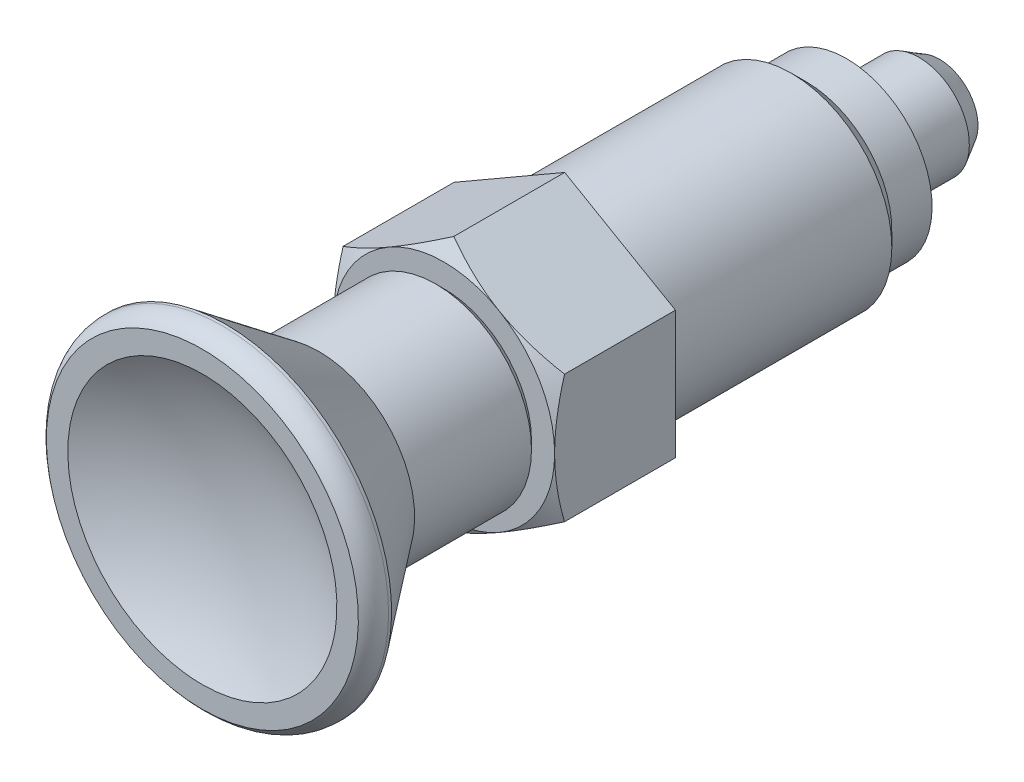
ISO-10303-21;
HEADER;
FILE_DESCRIPTION(('STEP AP214'),'2;1');
FILE_NAME('part.step','',(''),(''),'','','');
FILE_SCHEMA(('AUTOMOTIVE_DESIGN { 1 0 10303 214 1 1 1 1 }'));
ENDSEC;
DATA;
#1=APPLICATION_CONTEXT('core data for automotive mechanical design processes');
#2=APPLICATION_PROTOCOL_DEFINITION('international standard','automotive_design',2000,#1);
#3=PRODUCT_CONTEXT('',#1,'mechanical');
#4=PRODUCT('Part','Part','',(#3));
#5=PRODUCT_RELATED_PRODUCT_CATEGORY('part','',(#4));
#6=PRODUCT_DEFINITION_FORMATION('','',#4);
#7=PRODUCT_DEFINITION_CONTEXT('part definition',#1,'design');
#8=PRODUCT_DEFINITION('design','',#6,#7);
#9=PRODUCT_DEFINITION_SHAPE('','',#8);
#10=(LENGTH_UNIT() NAMED_UNIT(*) SI_UNIT(.MILLI.,.METRE.));
#11=(NAMED_UNIT(*) PLANE_ANGLE_UNIT() SI_UNIT($,.RADIAN.));
#12=(NAMED_UNIT(*) SI_UNIT($,.STERADIAN.) SOLID_ANGLE_UNIT());
#13=UNCERTAINTY_MEASURE_WITH_UNIT(LENGTH_MEASURE(1.E-05),#10,'distance_accuracy_value','');
#14=(GEOMETRIC_REPRESENTATION_CONTEXT(3) GLOBAL_UNCERTAINTY_ASSIGNED_CONTEXT((#13)) GLOBAL_UNIT_ASSIGNED_CONTEXT((#10,
#11,#12)) REPRESENTATION_CONTEXT('',''));
#15=CARTESIAN_POINT('',(0.,0.,0.));
#16=DIRECTION('',(0.,0.,1.));
#17=DIRECTION('',(1.,0.,0.));
#18=AXIS2_PLACEMENT_3D('',#15,#16,#17);
#19=CARTESIAN_POINT('',(0.,0.,58.3));
#20=DIRECTION('',(1.,0.,0.));
#21=DIRECTION('',(0.,-1.,0.));
#22=AXIS2_PLACEMENT_3D('',#19,#20,#21);
#23=SPHERICAL_SURFACE('',#22,26.);
#24=CARTESIAN_POINT('',(0.,-13.3682459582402,36.));
#25=CARTESIAN_POINT('',(0.375585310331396,-13.3682486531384,36.));
#26=CARTESIAN_POINT('',(0.751126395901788,-13.3524111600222,36.));
#27=CARTESIAN_POINT('',(1.49966463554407,-13.2891717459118,36.));
#28=CARTESIAN_POINT('',(1.87266109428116,-13.2417615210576,36.));
#29=CARTESIAN_POINT('',(2.61372997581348,-13.1156339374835,36.));
#30=CARTESIAN_POINT('',(2.98179666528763,-13.0368829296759,36.));
#31=CARTESIAN_POINT('',(3.70998226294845,-12.8486360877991,36.));
#32=CARTESIAN_POINT('',(4.07010119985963,-12.7391403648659,36.));
#33=CARTESIAN_POINT('',(4.77965529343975,-12.4902434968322,36.));
#34=CARTESIAN_POINT('',(5.12909553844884,-12.3508568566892,36.));
#35=CARTESIAN_POINT('',(5.8149955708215,-12.0431356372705,36.));
#36=CARTESIAN_POINT('',(6.15145515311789,-11.8748006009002,36.));
#37=CARTESIAN_POINT('',(6.80891126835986,-11.5104276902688,36.));
#38=CARTESIAN_POINT('',(7.12991172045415,-11.314396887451,36.));
#39=CARTESIAN_POINT('',(7.75425858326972,-10.8959942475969,36.));
#40=CARTESIAN_POINT('',(8.05760506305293,-10.673622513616,36.));
#41=CARTESIAN_POINT('',(8.64452045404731,-10.2040929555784,36.));
#42=CARTESIAN_POINT('',(8.92808725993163,-9.95693249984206,36.));
#43=CARTESIAN_POINT('',(9.4733922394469,-9.43960204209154,36.));
#44=CARTESIAN_POINT('',(9.7351303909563,-9.16943201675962,36.));
#45=CARTESIAN_POINT('',(10.2349267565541,-8.60799236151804,36.));
#46=CARTESIAN_POINT('',(10.472984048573,-8.31672191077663,36.));
#47=CARTESIAN_POINT('',(10.9237145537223,-7.7151616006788,36.));
#48=CARTESIAN_POINT('',(11.1363877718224,-7.40487174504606,36.));
#49=CARTESIAN_POINT('',(11.5348344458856,-6.76748455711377,36.));
#50=CARTESIAN_POINT('',(11.7206084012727,-6.44038753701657,36.));
#51=CARTESIAN_POINT('',(12.063940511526,-5.77170618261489,36.));
#52=CARTESIAN_POINT('',(12.2214986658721,-5.43012184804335,36.));
#53=CARTESIAN_POINT('',(12.5072787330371,-4.73489504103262,36.));
#54=CARTESIAN_POINT('',(12.6355007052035,-4.38125259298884,36.));
#55=CARTESIAN_POINT('',(12.8616972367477,-3.66442308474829,36.));
#56=CARTESIAN_POINT('',(12.9596717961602,-3.30123602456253,36.));
#57=CARTESIAN_POINT('',(13.1246771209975,-2.56789862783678,36.));
#58=CARTESIAN_POINT('',(13.1917078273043,-2.19774827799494,36.));
#59=CARTESIAN_POINT('',(13.2943486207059,-1.45311652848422,36.));
#60=CARTESIAN_POINT('',(13.3299587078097,-1.07863512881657,36.));
#61=CARTESIAN_POINT('',(13.3695050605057,-0.328004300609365,36.));
#62=CARTESIAN_POINT('',(13.373441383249,0.0481451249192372,36.));
#63=CARTESIAN_POINT('',(13.3496123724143,0.7994384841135,36.));
#64=CARTESIAN_POINT('',(13.3218470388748,1.17458241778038,36.));
#65=CARTESIAN_POINT('',(13.2348120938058,1.92119788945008,36.));
#66=CARTESIAN_POINT('',(13.1755424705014,2.29266942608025,36.));
#67=CARTESIAN_POINT('',(13.0259203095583,3.02929902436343,36.));
#68=CARTESIAN_POINT('',(12.9355677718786,3.39445708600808,36.));
#69=CARTESIAN_POINT('',(12.7244220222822,4.11586406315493,36.));
#70=CARTESIAN_POINT('',(12.6036287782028,4.47211296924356,36.));
#71=CARTESIAN_POINT('',(12.3324604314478,5.17316851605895,36.));
#72=CARTESIAN_POINT('',(12.182085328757,5.51797515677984,36.));
#73=CARTESIAN_POINT('',(11.8528223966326,6.19369469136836,36.));
#74=CARTESIAN_POINT('',(11.6739345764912,6.5246075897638,36.));
#75=CARTESIAN_POINT('',(11.2889179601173,7.17018716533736,36.));
#76=CARTESIAN_POINT('',(11.0827891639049,7.48485384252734,36.));
#77=CARTESIAN_POINT('',(10.644756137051,8.09570375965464,36.));
#78=CARTESIAN_POINT('',(10.4128519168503,8.39188700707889,36.));
#79=CARTESIAN_POINT('',(9.92491667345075,8.96366451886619,36.));
#80=CARTESIAN_POINT('',(9.66888565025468,9.23925878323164,36.));
#81=CARTESIAN_POINT('',(9.13451699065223,9.76789905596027,36.));
#82=CARTESIAN_POINT('',(8.85617935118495,10.0209450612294,36.));
#83=CARTESIAN_POINT('',(8.2791763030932,10.5026897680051,36.));
#84=CARTESIAN_POINT('',(7.98051089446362,10.7313884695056,36.));
#85=CARTESIAN_POINT('',(7.36497559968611,11.1628126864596,36.));
#86=CARTESIAN_POINT('',(7.04810571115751,11.3655381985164,36.));
#87=CARTESIAN_POINT('',(6.39841424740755,11.7435747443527,36.));
#88=CARTESIAN_POINT('',(6.06559267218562,11.9188857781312,36.));
#89=CARTESIAN_POINT('',(5.38636401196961,12.2408470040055,36.));
#90=CARTESIAN_POINT('',(5.03995692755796,12.3874971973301,36.));
#91=CARTESIAN_POINT('',(4.33601998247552,12.6510941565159,36.));
#92=CARTESIAN_POINT('',(3.9784901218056,12.7680409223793,36.));
#93=CARTESIAN_POINT('',(3.25484946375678,12.9713996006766,36.));
#94=CARTESIAN_POINT('',(2.8887386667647,13.0578115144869,36.));
#95=CARTESIAN_POINT('',(2.15053894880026,13.1994861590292,36.));
#96=CARTESIAN_POINT('',(1.77845002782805,13.2547488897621,36.));
#97=CARTESIAN_POINT('',(1.03093939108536,13.3337322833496,36.));
#98=CARTESIAN_POINT('',(0.655517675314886,13.3574529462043,36.));
#99=CARTESIAN_POINT('',(-0.0959895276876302,13.3731835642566,36.));
#100=CARTESIAN_POINT('',(-0.472075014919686,13.3651935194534,36.));
#101=CARTESIAN_POINT('',(-1.22223603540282,13.3175595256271,36.));
#102=CARTESIAN_POINT('',(-1.5963115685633,13.277915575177,36.));
#103=CARTESIAN_POINT('',(-2.33979321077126,13.1672556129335,36.));
#104=CARTESIAN_POINT('',(-2.70919931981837,13.0962396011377,36.));
#105=CARTESIAN_POINT('',(-3.44071587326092,12.9233403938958,36.));
#106=CARTESIAN_POINT('',(-3.80282631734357,12.8214571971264,36.));
#107=CARTESIAN_POINT('',(-4.51717713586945,12.5875479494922,36.));
#108=CARTESIAN_POINT('',(-4.86941751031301,12.4555218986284,36.));
#109=CARTESIAN_POINT('',(-5.56152392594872,12.1622655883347,36.));
#110=CARTESIAN_POINT('',(-5.90138996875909,12.001035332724,36.));
#111=CARTESIAN_POINT('',(-6.56633152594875,11.6505168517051,36.));
#112=CARTESIAN_POINT('',(-6.89140704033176,11.461228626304,36.));
#113=CARTESIAN_POINT('',(-7.52445640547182,11.0559399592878,36.));
#114=CARTESIAN_POINT('',(-7.83243025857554,10.8399395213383,36.));
#115=CARTESIAN_POINT('',(-8.42908684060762,10.3827620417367,36.));
#116=CARTESIAN_POINT('',(-8.71776956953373,10.1415850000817,36.));
#117=CARTESIAN_POINT('',(-9.27379165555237,9.63576883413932,36.));
#118=CARTESIAN_POINT('',(-9.54113100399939,9.37112970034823,36.));
#119=CARTESIAN_POINT('',(-10.0525655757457,8.82027085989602,36.));
#120=CARTESIAN_POINT('',(-10.296660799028,8.53405115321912,36.));
#121=CARTESIAN_POINT('',(-10.7598718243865,7.9420659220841,36.));
#122=CARTESIAN_POINT('',(-10.9789876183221,7.63630039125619,36.));
#123=CARTESIAN_POINT('',(-11.3906819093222,7.0073974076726,36.));
#124=CARTESIAN_POINT('',(-11.5832604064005,6.68425995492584,36.));
#125=CARTESIAN_POINT('',(-11.9405107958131,6.02291079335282,36.));
#126=CARTESIAN_POINT('',(-12.1051827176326,5.68469910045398,36.));
#127=CARTESIAN_POINT('',(-12.405449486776,4.9956056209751,36.));
#128=CARTESIAN_POINT('',(-12.5410443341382,4.64472383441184,36.));
#129=CARTESIAN_POINT('',(-12.782192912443,3.93278485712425,36.));
#130=CARTESIAN_POINT('',(-12.8877466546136,3.5717276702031,36.));
#131=CARTESIAN_POINT('',(-13.0680626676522,2.84200466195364,36.));
#132=CARTESIAN_POINT('',(-13.1428249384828,2.4733388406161,36.));
#133=CARTESIAN_POINT('',(-13.2610266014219,1.73101888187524,36.));
#134=CARTESIAN_POINT('',(-13.3044659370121,1.35736473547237,36.));
#135=CARTESIAN_POINT('',(-13.3597126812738,0.607725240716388,36.));
#136=CARTESIAN_POINT('',(-13.3715200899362,0.231739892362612,36.));
#137=CARTESIAN_POINT('',(-13.3634190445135,-0.519888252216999,36.));
#138=CARTESIAN_POINT('',(-13.3435106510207,-0.895531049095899,36.));
#139=CARTESIAN_POINT('',(-13.2721196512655,-1.64380422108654,36.));
#140=CARTESIAN_POINT('',(-13.2206370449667,-2.01643459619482,36.));
#141=CARTESIAN_POINT('',(-13.0864634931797,-2.75603450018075,36.));
#142=CARTESIAN_POINT('',(-13.0037724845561,-3.12300401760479,36.));
#143=CARTESIAN_POINT('',(-12.8077700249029,-3.84867248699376,36.));
#144=CARTESIAN_POINT('',(-12.6944585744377,-4.20737143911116,36.));
#145=CARTESIAN_POINT('',(-12.4380184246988,-4.91395521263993,36.));
#146=CARTESIAN_POINT('',(-12.2948891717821,-5.26183983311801,36.));
#147=CARTESIAN_POINT('',(-11.9798322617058,-5.94431469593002,36.));
#148=CARTESIAN_POINT('',(-11.8079045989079,-6.27890493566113,36.));
#149=CARTESIAN_POINT('',(-11.4364804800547,-6.93239940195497,36.));
#150=CARTESIAN_POINT('',(-11.2369850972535,-7.25130423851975,36.));
#151=CARTESIAN_POINT('',(-10.8118388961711,-7.87117441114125,36.));
#152=CARTESIAN_POINT('',(-10.5861881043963,-8.17213976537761,36.));
#153=CARTESIAN_POINT('',(-10.110360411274,-8.75396077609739,36.));
#154=CARTESIAN_POINT('',(-9.86018611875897,-9.03481856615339,36.));
#155=CARTESIAN_POINT('',(-9.33706848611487,-9.57446448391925,36.));
#156=CARTESIAN_POINT('',(-9.06412505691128,-9.83325252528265,36.));
#157=CARTESIAN_POINT('',(-8.49733759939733,-10.3269813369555,36.));
#158=CARTESIAN_POINT('',(-8.20348826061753,-10.5619160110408,36.));
#159=CARTESIAN_POINT('',(-7.59704532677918,-11.0061886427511,36.));
#160=CARTESIAN_POINT('',(-7.28445202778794,-11.2155270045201,36.));
#161=CARTESIAN_POINT('',(-6.6425836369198,-11.6072177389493,36.));
#162=CARTESIAN_POINT('',(-6.31330053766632,-11.7895569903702,36.));
#163=CARTESIAN_POINT('',(-5.64053678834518,-12.1258308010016,36.));
#164=CARTESIAN_POINT('',(-5.2970560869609,-12.2797652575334,36.));
#165=CARTESIAN_POINT('',(-4.59871120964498,-12.5579840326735,36.));
#166=CARTESIAN_POINT('',(-4.24385967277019,-12.682300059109,36.));
#167=CARTESIAN_POINT('',(-3.5250673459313,-12.9005804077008,36.));
#168=CARTESIAN_POINT('',(-3.16112897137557,-12.99455270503,36.));
#169=CARTESIAN_POINT('',(-2.33514245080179,-13.1710678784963,36.));
#170=CARTESIAN_POINT('',(-1.87121744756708,-13.2449469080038,36.));
#171=CARTESIAN_POINT('',(-0.938171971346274,-13.3435342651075,36.));
#172=CARTESIAN_POINT('',(-0.46905149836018,-13.3682425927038,36.));
#173=CARTESIAN_POINT('',(0.,-13.3682459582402,36.));
#174=B_SPLINE_CURVE_WITH_KNOTS('',3,(#24,#25,#26,#27,#28,#29,#30,#31,#32,#33,#34,#35,#36,#37,
#38,#39,#40,#41,#42,#43,#44,#45,#46,#47,#48,#49,#50,#51,#52,#53,#54,#55,#56,#57,#58,#59,#60,#61,
#62,#63,#64,#65,#66,#67,#68,#69,#70,#71,#72,#73,#74,#75,#76,#77,#78,#79,#80,#81,#82,#83,#84,#85,
#86,#87,#88,#89,#90,#91,#92,#93,#94,#95,#96,#97,#98,#99,#100,#101,#102,#103,#104,#105,#106,#107,
#108,#109,#110,#111,#112,#113,#114,#115,#116,#117,#118,#119,#120,#121,#122,#123,#124,#125,#126,
#127,#128,#129,#130,#131,#132,#133,#134,#135,#136,#137,#138,#139,#140,#141,#142,#143,#144,#145,
#146,#147,#148,#149,#150,#151,#152,#153,#154,#155,#156,#157,#158,#159,#160,#161,#162,#163,#164,
#165,#166,#167,#168,#169,#170,#171,#172,#173),.UNSPECIFIED.,.T.,.F.,(4,2,2,2,2,2,2,2,2,2,2,2,2,
2,2,2,2,2,2,2,2,2,2,2,2,2,2,2,2,2,2,2,2,2,2,2,2,2,2,2,2,2,2,2,2,2,2,2,2,2,2,2,2,2,2,2,2,2,2,2,2,
2,2,2,2,2,2,2,2,2,2,2,2,2,4),(0.,1.12634621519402,2.25298878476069,3.38084425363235,
4.50869564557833,5.63600096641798,6.76332408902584,7.89035989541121,9.01739129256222,
10.1445424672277,11.2716947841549,12.3988909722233,13.5260869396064,14.6532619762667,
15.7804370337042,16.907609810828,18.0347825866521,19.1619575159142,20.2891324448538,
21.4163053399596,22.5434782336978,23.6706515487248,24.7978248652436,25.9249993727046,
27.0521738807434,28.1793480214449,29.3065221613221,30.4336958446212,31.5608695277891,
32.6880433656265,33.8152172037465,34.9423911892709,36.0695651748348,37.1967391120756,
38.3239130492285,39.4510869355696,40.5782608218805,41.7054347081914,42.8326085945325,
43.9597825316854,45.0869564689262,46.2141304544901,47.3413044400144,48.4684782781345,
49.5956521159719,50.7228257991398,51.8499994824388,52.9771736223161,54.1043477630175,
55.2315222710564,56.3586967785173,57.4858700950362,58.6130434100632,59.7402163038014,
60.8673891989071,61.9945641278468,63.1217390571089,64.248911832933,65.3760846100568,
66.5032596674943,67.6304347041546,68.7576306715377,69.8848268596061,71.0119791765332,
72.1391303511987,73.2661617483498,74.3931975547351,75.520520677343,76.6478259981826,
77.7756773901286,78.9035328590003,80.0301754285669,81.1565216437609,82.5631644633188,
83.9698072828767),.UNSPECIFIED.);
#175=CARTESIAN_POINT('',(0.,-13.3682459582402,36.));
#176=VERTEX_POINT('',#175);
#177=EDGE_CURVE('E19',#176,#176,#174,.T.);
#178=ORIENTED_EDGE('',*,*,#177,.T.);
#179=EDGE_LOOP('',(#178));
#180=FACE_BOUND('',#179,.T.);
#181=ADVANCED_FACE('F14',(#180),#23,.F.);
#182=CARTESIAN_POINT('',(-13.36824595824,0.,36.));
#183=DIRECTION('',(0.,0.,-1.));
#184=DIRECTION('',(0.,-1.,0.));
#185=AXIS2_PLACEMENT_3D('',#182,#183,#184);
#186=PLANE('',#185);
#187=ORIENTED_EDGE('',*,*,#177,.F.);
#188=EDGE_LOOP('',(#187));
#189=FACE_BOUND('',#188,.T.);
#190=CARTESIAN_POINT('',(0.,0.,36.));
#191=DIRECTION('',(0.,0.,-1.));
#192=DIRECTION('',(0.,-1.,0.));
#193=AXIS2_PLACEMENT_3D('',#190,#191,#192);
#194=CIRCLE('',#193,15.5);
#195=CARTESIAN_POINT('',(0.,-15.5,36.));
#196=VERTEX_POINT('',#195);
#197=EDGE_CURVE('E422',#196,#196,#194,.T.);
#198=ORIENTED_EDGE('',*,*,#197,.F.);
#199=EDGE_LOOP('',(#198));
#200=FACE_BOUND('',#199,.T.);
#201=ADVANCED_FACE('F357',(#189,#200),#186,.F.);
#202=CARTESIAN_POINT('',(0.,0.,-28.));
#203=DIRECTION('',(1.,0.,0.));
#204=DIRECTION('',(0.,-1.,0.));
#205=AXIS2_PLACEMENT_3D('',#202,#203,#204);
#206=SPHERICAL_SURFACE('',#205,10.);
#207=CARTESIAN_POINT('',(0.,0.,-37.2409344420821));
#208=DIRECTION('',(0.,0.,1.));
#209=DIRECTION('',(0.,1.,0.));
#210=AXIS2_PLACEMENT_3D('',#207,#208,#209);
#211=CIRCLE('',#210,3.82166595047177);
#212=CARTESIAN_POINT('',(0.,3.82166595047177,-37.2409344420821));
#213=VERTEX_POINT('',#212);
#214=EDGE_CURVE('E341',#213,#213,#211,.T.);
#215=ORIENTED_EDGE('',*,*,#214,.F.);
#216=EDGE_LOOP('',(#215));
#217=FACE_BOUND('',#216,.T.);
#218=ADVANCED_FACE('F353',(#217),#206,.T.);
#219=CARTESIAN_POINT('',(0.,0.,34.));
#220=DIRECTION('',(0.,0.,-1.));
#221=DIRECTION('',(0.,-1.,0.));
#222=AXIS2_PLACEMENT_3D('',#219,#220,#221);
#223=TOROIDAL_SURFACE('',#222,14.,2.5);
#224=CARTESIAN_POINT('',(0.,0.,34.));
#225=DIRECTION('',(0.,0.,1.));
#226=DIRECTION('',(0.,1.,0.));
#227=AXIS2_PLACEMENT_3D('',#224,#225,#226);
#228=CIRCLE('',#227,16.5);
#229=CARTESIAN_POINT('',(0.,16.5,34.));
#230=VERTEX_POINT('',#229);
#231=EDGE_CURVE('E336',#230,#230,#228,.F.);
#232=ORIENTED_EDGE('',*,*,#231,.F.);
#233=EDGE_LOOP('',(#232));
#234=FACE_BOUND('',#233,.T.);
#235=ORIENTED_EDGE('',*,*,#197,.T.);
#236=EDGE_LOOP('',(#235));
#237=FACE_BOUND('',#236,.T.);
#238=ADVANCED_FACE('F348',(#234,#237),#223,.T.);
#239=CARTESIAN_POINT('',(0.,0.,-35.2000000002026));
#240=DIRECTION('',(0.,0.,1.));
#241=DIRECTION('',(0.,1.,0.));
#242=AXIS2_PLACEMENT_3D('',#239,#240,#241);
#243=CONICAL_SURFACE('',#242,4.99999999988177,0.523598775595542);
#244=CARTESIAN_POINT('',(0.,0.,-35.2));
#245=DIRECTION('',(0.,0.,1.));
#246=DIRECTION('',(0.,1.,0.));
#247=AXIS2_PLACEMENT_3D('',#244,#245,#246);
#248=CIRCLE('',#247,5.);
#249=CARTESIAN_POINT('',(0.,5.,-35.2));
#250=VERTEX_POINT('',#249);
#251=EDGE_CURVE('E331',#250,#250,#248,.T.);
#252=ORIENTED_EDGE('',*,*,#251,.F.);
#253=EDGE_LOOP('',(#252));
#254=FACE_BOUND('',#253,.T.);
#255=ORIENTED_EDGE('',*,*,#214,.T.);
#256=EDGE_LOOP('',(#255));
#257=FACE_BOUND('',#256,.T.);
#258=ADVANCED_FACE('F352',(#254,#257),#243,.T.);
#259=CARTESIAN_POINT('',(0.,0.,-38.));
#260=DIRECTION('',(0.,0.,1.));
#261=DIRECTION('',(0.,1.,0.));
#262=AXIS2_PLACEMENT_3D('',#259,#260,#261);
#263=CYLINDRICAL_SURFACE('',#262,16.5);
#264=ORIENTED_EDGE('',*,*,#231,.T.);
#265=EDGE_LOOP('',(#264));
#266=FACE_BOUND('',#265,.T.);
#267=CARTESIAN_POINT('',(0.,0.,33.7));
#268=DIRECTION('',(0.,0.,1.));
#269=DIRECTION('',(0.,1.,0.));
#270=AXIS2_PLACEMENT_3D('',#267,#268,#269);
#271=CIRCLE('',#270,16.5);
#272=CARTESIAN_POINT('',(0.,16.5,33.7));
#273=VERTEX_POINT('',#272);
#274=EDGE_CURVE('E318',#273,#273,#271,.F.);
#275=ORIENTED_EDGE('',*,*,#274,.F.);
#276=EDGE_LOOP('',(#275));
#277=FACE_BOUND('',#276,.T.);
#278=ADVANCED_FACE('F430',(#266,#277),#263,.T.);
#279=CARTESIAN_POINT('',(0.,0.,-38.));
#280=DIRECTION('',(0.,0.,1.));
#281=DIRECTION('',(0.,1.,0.));
#282=AXIS2_PLACEMENT_3D('',#279,#280,#281);
#283=CYLINDRICAL_SURFACE('',#282,5.);
#284=CARTESIAN_POINT('',(0.,0.,-28.3732050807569));
#285=DIRECTION('',(0.,0.,-1.));
#286=DIRECTION('',(0.,-1.,0.));
#287=AXIS2_PLACEMENT_3D('',#284,#285,#286);
#288=CIRCLE('',#287,5.);
#289=CARTESIAN_POINT('',(0.,-5.,-28.3732050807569));
#290=VERTEX_POINT('',#289);
#291=EDGE_CURVE('E315',#290,#290,#288,.T.);
#292=ORIENTED_EDGE('',*,*,#291,.T.);
#293=EDGE_LOOP('',(#292));
#294=FACE_BOUND('',#293,.T.);
#295=ORIENTED_EDGE('',*,*,#251,.T.);
#296=EDGE_LOOP('',(#295));
#297=FACE_BOUND('',#296,.T.);
#298=ADVANCED_FACE('F435',(#294,#297),#283,.T.);
#299=CARTESIAN_POINT('',(0.,0.,33.7));
#300=DIRECTION('',(0.,0.,1.));
#301=DIRECTION('',(1.,0.,0.));
#302=AXIS2_PLACEMENT_3D('',#299,#300,#301);
#303=CONICAL_SURFACE('',#302,16.5,0.645771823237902);
#304=ORIENTED_EDGE('',*,*,#274,.T.);
#305=EDGE_LOOP('',(#304));
#306=FACE_BOUND('',#305,.T.);
#307=CARTESIAN_POINT('',(0.,0.,24.4106862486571));
#308=DIRECTION('',(0.,0.,1.));
#309=DIRECTION('',(0.,1.,0.));
#310=AXIS2_PLACEMENT_3D('',#307,#308,#309);
#311=CIRCLE('',#310,9.5);
#312=CARTESIAN_POINT('',(0.,9.5,24.4106862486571));
#313=VERTEX_POINT('',#312);
#314=EDGE_CURVE('E284',#313,#313,#311,.F.);
#315=ORIENTED_EDGE('',*,*,#314,.F.);
#316=EDGE_LOOP('',(#315));
#317=FACE_BOUND('',#316,.T.);
#318=ADVANCED_FACE('F308',(#306,#317),#303,.T.);
#319=CARTESIAN_POINT('',(0.,0.,-28.2));
#320=DIRECTION('',(0.,0.,-1.));
#321=DIRECTION('',(0.,-1.,0.));
#322=AXIS2_PLACEMENT_3D('',#319,#320,#321);
#323=TOROIDAL_SURFACE('',#322,5.1,0.2);
#324=CARTESIAN_POINT('',(0.,0.,-28.));
#325=DIRECTION('',(0.,0.,-1.));
#326=DIRECTION('',(0.,-1.,0.));
#327=AXIS2_PLACEMENT_3D('',#324,#325,#326);
#328=CIRCLE('',#327,5.1);
#329=CARTESIAN_POINT('',(0.,-5.1,-28.));
#330=VERTEX_POINT('',#329);
#331=EDGE_CURVE('E273',#330,#330,#328,.T.);
#332=ORIENTED_EDGE('',*,*,#331,.T.);
#333=EDGE_LOOP('',(#332));
#334=FACE_BOUND('',#333,.T.);
#335=ORIENTED_EDGE('',*,*,#291,.F.);
#336=EDGE_LOOP('',(#335));
#337=FACE_BOUND('',#336,.T.);
#338=ADVANCED_FACE('F302',(#334,#337),#323,.F.);
#339=CARTESIAN_POINT('',(0.,0.,-38.));
#340=DIRECTION('',(0.,0.,1.));
#341=DIRECTION('',(0.,1.,0.));
#342=AXIS2_PLACEMENT_3D('',#339,#340,#341);
#343=CYLINDRICAL_SURFACE('',#342,9.5);
#344=ORIENTED_EDGE('',*,*,#314,.T.);
#345=EDGE_LOOP('',(#344));
#346=FACE_BOUND('',#345,.T.);
#347=CARTESIAN_POINT('',(0.,0.,12.8));
#348=DIRECTION('',(0.,0.,1.));
#349=DIRECTION('',(0.,1.,0.));
#350=AXIS2_PLACEMENT_3D('',#347,#348,#349);
#351=CIRCLE('',#350,9.5);
#352=CARTESIAN_POINT('',(0.,9.5,12.8));
#353=VERTEX_POINT('',#352);
#354=EDGE_CURVE('E269',#353,#353,#351,.F.);
#355=ORIENTED_EDGE('',*,*,#354,.F.);
#356=EDGE_LOOP('',(#355));
#357=FACE_BOUND('',#356,.T.);
#358=ADVANCED_FACE('F297',(#346,#357),#343,.T.);
#359=CARTESIAN_POINT('',(-5.2,0.,-28.));
#360=DIRECTION('',(0.,0.,1.));
#361=DIRECTION('',(0.,1.,0.));
#362=AXIS2_PLACEMENT_3D('',#359,#360,#361);
#363=PLANE('',#362);
#364=CARTESIAN_POINT('',(0.,0.,-27.9999999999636));
#365=DIRECTION('',(0.,0.,1.));
#366=DIRECTION('',(0.,1.,0.));
#367=AXIS2_PLACEMENT_3D('',#364,#365,#366);
#368=CIRCLE('',#367,5.19999999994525);
#369=CARTESIAN_POINT('',(0.,5.19999999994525,-27.9999999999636));
#370=VERTEX_POINT('',#369);
#371=EDGE_CURVE('E272',#370,#370,#368,.T.);
#372=ORIENTED_EDGE('',*,*,#371,.F.);
#373=EDGE_LOOP('',(#372));
#374=FACE_BOUND('',#373,.T.);
#375=ORIENTED_EDGE('',*,*,#331,.F.);
#376=EDGE_LOOP('',(#375));
#377=FACE_BOUND('',#376,.T.);
#378=ADVANCED_FACE('F286',(#374,#377),#363,.F.);
#379=CARTESIAN_POINT('',(0.,0.,12.8));
#380=DIRECTION('',(0.,0.,1.));
#381=DIRECTION('',(1.,0.,0.));
#382=AXIS2_PLACEMENT_3D('',#379,#380,#381);
#383=CONICAL_SURFACE('',#382,9.5,0.785398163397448);
#384=ORIENTED_EDGE('',*,*,#354,.T.);
#385=EDGE_LOOP('',(#384));
#386=FACE_BOUND('',#385,.T.);
#387=CARTESIAN_POINT('',(0.,0.,12.));
#388=DIRECTION('',(0.,0.,1.));
#389=DIRECTION('',(1.,0.,0.));
#390=AXIS2_PLACEMENT_3D('',#387,#388,#389);
#391=CIRCLE('',#390,8.7);
#392=CARTESIAN_POINT('',(8.7,0.,12.));
#393=VERTEX_POINT('',#392);
#394=EDGE_CURVE('E266',#393,#393,#391,.F.);
#395=ORIENTED_EDGE('',*,*,#394,.F.);
#396=EDGE_LOOP('',(#395));
#397=FACE_BOUND('',#396,.T.);
#398=ADVANCED_FACE('F296',(#386,#397),#383,.T.);
#399=CARTESIAN_POINT('',(0.,0.,-27.6999999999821));
#400=DIRECTION('',(0.,0.,1.));
#401=DIRECTION('',(0.,1.,0.));
#402=AXIS2_PLACEMENT_3D('',#399,#400,#401);
#403=CONICAL_SURFACE('',#402,5.49999999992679,0.785398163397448);
#404=CARTESIAN_POINT('',(0.,0.,-27.7));
#405=DIRECTION('',(0.,0.,1.));
#406=DIRECTION('',(0.,1.,0.));
#407=AXIS2_PLACEMENT_3D('',#404,#405,#406);
#408=CIRCLE('',#407,5.5);
#409=CARTESIAN_POINT('',(0.,5.5,-27.7));
#410=VERTEX_POINT('',#409);
#411=EDGE_CURVE('E99',#410,#410,#408,.F.);
#412=ORIENTED_EDGE('',*,*,#411,.T.);
#413=EDGE_LOOP('',(#412));
#414=FACE_BOUND('',#413,.T.);
#415=ORIENTED_EDGE('',*,*,#371,.T.);
#416=EDGE_LOOP('',(#415));
#417=FACE_BOUND('',#416,.T.);
#418=ADVANCED_FACE('F458',(#414,#417),#403,.T.);
#419=CARTESIAN_POINT('',(-11.,0.,12.));
#420=DIRECTION('',(0.,0.,1.));
#421=DIRECTION('',(0.,1.,0.));
#422=AXIS2_PLACEMENT_3D('',#419,#420,#421);
#423=PLANE('',#422);
#424=CARTESIAN_POINT('',(0.,0.,12.));
#425=DIRECTION('',(0.,0.,-1.));
#426=DIRECTION('',(0.,-1.,0.));
#427=AXIS2_PLACEMENT_3D('',#424,#425,#426);
#428=CIRCLE('',#427,11.);
#429=CARTESIAN_POINT('',(5.5,9.52627944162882,12.));
#430=VERTEX_POINT('',#429);
#431=CARTESIAN_POINT('',(11.,0.,12.));
#432=VERTEX_POINT('',#431);
#433=EDGE_CURVE('E394',#430,#432,#428,.T.);
#434=ORIENTED_EDGE('',*,*,#433,.F.);
#435=CARTESIAN_POINT('',(0.,0.,12.));
#436=DIRECTION('',(0.,0.,-1.));
#437=DIRECTION('',(-1.,0.,0.));
#438=AXIS2_PLACEMENT_3D('',#435,#436,#437);
#439=CIRCLE('',#438,11.);
#440=CARTESIAN_POINT('',(-5.5,9.52627944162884,12.));
#441=VERTEX_POINT('',#440);
#442=EDGE_CURVE('E397',#441,#430,#439,.T.);
#443=ORIENTED_EDGE('',*,*,#442,.F.);
#444=CARTESIAN_POINT('',(0.,0.,12.));
#445=DIRECTION('',(0.,0.,-1.));
#446=DIRECTION('',(0.,-1.,0.));
#447=AXIS2_PLACEMENT_3D('',#444,#445,#446);
#448=CIRCLE('',#447,11.);
#449=CARTESIAN_POINT('',(-11.,0.,12.));
#450=VERTEX_POINT('',#449);
#451=EDGE_CURVE('E94',#450,#441,#448,.T.);
#452=ORIENTED_EDGE('',*,*,#451,.F.);
#453=CARTESIAN_POINT('',(0.,0.,12.));
#454=DIRECTION('',(0.,0.,-1.));
#455=DIRECTION('',(0.,-1.,0.));
#456=AXIS2_PLACEMENT_3D('',#453,#454,#455);
#457=CIRCLE('',#456,11.);
#458=CARTESIAN_POINT('',(-5.5,-9.52627944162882,12.));
#459=VERTEX_POINT('',#458);
#460=EDGE_CURVE('E87',#459,#450,#457,.T.);
#461=ORIENTED_EDGE('',*,*,#460,.F.);
#462=CARTESIAN_POINT('',(0.,0.,12.));
#463=DIRECTION('',(0.,0.,-1.));
#464=DIRECTION('',(-1.,0.,0.));
#465=AXIS2_PLACEMENT_3D('',#462,#463,#464);
#466=CIRCLE('',#465,11.);
#467=CARTESIAN_POINT('',(5.5,-9.52627944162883,12.));
#468=VERTEX_POINT('',#467);
#469=EDGE_CURVE('E91',#468,#459,#466,.T.);
#470=ORIENTED_EDGE('',*,*,#469,.F.);
#471=CARTESIAN_POINT('',(0.,0.,12.));
#472=DIRECTION('',(0.,0.,-1.));
#473=DIRECTION('',(0.,-1.,0.));
#474=AXIS2_PLACEMENT_3D('',#471,#472,#473);
#475=CIRCLE('',#474,11.);
#476=EDGE_CURVE('E111',#432,#468,#475,.T.);
#477=ORIENTED_EDGE('',*,*,#476,.F.);
#478=EDGE_LOOP('',(#434,#443,#452,#461,#470,#477));
#479=FACE_BOUND('',#478,.T.);
#480=ORIENTED_EDGE('',*,*,#394,.T.);
#481=EDGE_LOOP('',(#480));
#482=FACE_BOUND('',#481,.T.);
#483=ADVANCED_FACE('F89',(#479,#482),#423,.T.);
#484=CARTESIAN_POINT('',(0.,0.,-28.));
#485=DIRECTION('',(0.,0.,1.));
#486=DIRECTION('',(0.,1.,0.));
#487=AXIS2_PLACEMENT_3D('',#484,#485,#486);
#488=CYLINDRICAL_SURFACE('',#487,5.5);
#489=ORIENTED_EDGE('',*,*,#411,.F.);
#490=EDGE_LOOP('',(#489));
#491=FACE_BOUND('',#490,.T.);
#492=CARTESIAN_POINT('',(0.,0.,-28.));
#493=DIRECTION('',(0.,0.,1.));
#494=DIRECTION('',(0.,1.,0.));
#495=AXIS2_PLACEMENT_3D('',#492,#493,#494);
#496=CIRCLE('',#495,5.5);
#497=CARTESIAN_POINT('',(0.,5.5,-28.));
#498=VERTEX_POINT('',#497);
#499=EDGE_CURVE('E110',#498,#498,#496,.T.);
#500=ORIENTED_EDGE('',*,*,#499,.F.);
#501=EDGE_LOOP('',(#500));
#502=FACE_BOUND('',#501,.T.);
#503=ADVANCED_FACE('F461',(#491,#502),#488,.F.);
#504=CARTESIAN_POINT('',(0.,0.,11.0116247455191));
#505=DIRECTION('',(0.,0.,-1.));
#506=DIRECTION('',(0.,-1.,0.));
#507=AXIS2_PLACEMENT_3D('',#504,#505,#506);
#508=CONICAL_SURFACE('',#507,12.7119161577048,1.0471975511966);
#509=CARTESIAN_POINT('',(-11.,-6.35085296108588,11.0175196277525));
#510=CARTESIAN_POINT('',(-11.,-5.83365891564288,11.166804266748));
#511=CARTESIAN_POINT('',(-11.,-5.31266890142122,11.3035576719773));
#512=CARTESIAN_POINT('',(-11.,-4.52706803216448,11.4845812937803));
#513=CARTESIAN_POINT('',(-11.,-4.26516474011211,11.5407957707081));
#514=CARTESIAN_POINT('',(-11.,-3.73964119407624,11.6445383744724));
#515=CARTESIAN_POINT('',(-11.,-3.47602104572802,11.6920670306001));
#516=CARTESIAN_POINT('',(-11.,-2.9469191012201,11.7776806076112));
#517=CARTESIAN_POINT('',(-11.,-2.68143544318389,11.8157540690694));
#518=CARTESIAN_POINT('',(-11.,-2.14919833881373,11.8816573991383));
#519=CARTESIAN_POINT('',(-11.,-1.88244492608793,11.9094875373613));
#520=CARTESIAN_POINT('',(-11.,-1.34668014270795,11.9544193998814));
#521=CARTESIAN_POINT('',(-11.,-1.07766415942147,11.9714665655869));
#522=CARTESIAN_POINT('',(-11.,-0.539103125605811,11.9942806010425));
#523=CARTESIAN_POINT('',(-11.,-0.269557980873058,12.0000452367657));
#524=CARTESIAN_POINT('',(-11.,0.,12.));
#525=B_SPLINE_CURVE_WITH_KNOTS('',3,(#509,#510,#511,#512,#513,#514,#515,#516,#517,#518,#519,
#520,#521,#522,#523,#524),.UNSPECIFIED.,.F.,.F.,(4,2,2,2,2,2,2,4),(0.,1.61488064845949,
2.4183753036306,3.22182097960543,4.02623570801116,4.83062926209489,5.63906091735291,
6.44765263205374),.UNSPECIFIED.);
#526=CARTESIAN_POINT('',(-11.,-6.35085296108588,11.0175196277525));
#527=VERTEX_POINT('',#526);
#528=EDGE_CURVE('E116',#527,#450,#525,.T.);
#529=ORIENTED_EDGE('',*,*,#528,.F.);
#530=CARTESIAN_POINT('',(-5.5,-9.52627944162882,12.));
#531=CARTESIAN_POINT('',(-5.73344405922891,-9.39150045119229,12.0000452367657));
#532=CARTESIAN_POINT('',(-5.96687700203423,-9.25672787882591,11.9942806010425));
#533=CARTESIAN_POINT('',(-6.433284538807,-8.98744736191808,11.9714665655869));
#534=CARTESIAN_POINT('',(-6.66625921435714,-8.85293937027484,11.9544193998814));
#535=CARTESIAN_POINT('',(-7.13024512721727,-8.58505697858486,11.9094875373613));
#536=CARTESIAN_POINT('',(-7.36126035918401,-8.45168027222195,11.8816573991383));
#537=CARTESIAN_POINT('',(-7.82219121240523,-8.18556172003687,11.8157540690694));
#538=CARTESIAN_POINT('',(-8.05210680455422,-8.05281989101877,11.7776806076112));
#539=CARTESIAN_POINT('',(-8.51032252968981,-7.78826891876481,11.6920670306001));
#540=CARTESIAN_POINT('',(-8.7386242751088,-7.6564588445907,11.6445383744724));
#541=CARTESIAN_POINT('',(-9.19374101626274,-7.39369707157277,11.5407957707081));
#542=CARTESIAN_POINT('',(-9.42055592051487,-7.26274542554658,11.4845812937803));
#543=CARTESIAN_POINT('',(-10.1009062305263,-6.86994499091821,11.3035576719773));
#544=CARTESIAN_POINT('',(-10.5520968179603,-6.60944998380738,11.166804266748));
#545=CARTESIAN_POINT('',(-11.,-6.35085296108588,11.0175196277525));
#546=B_SPLINE_CURVE_WITH_KNOTS('',3,(#530,#531,#532,#533,#534,#535,#536,#537,#538,#539,#540,
#541,#542,#543,#544,#545),.UNSPECIFIED.,.F.,.F.,(4,2,2,2,2,2,2,4),(0.,0.808591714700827,
1.61702336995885,2.42141692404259,3.22583165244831,4.02927732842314,4.83277198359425,
6.44765263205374),.UNSPECIFIED.);
#547=EDGE_CURVE('E113',#459,#527,#546,.T.);
#548=ORIENTED_EDGE('',*,*,#547,.F.);
#549=ORIENTED_EDGE('',*,*,#460,.T.);
#550=EDGE_LOOP('',(#529,#548,#549));
#551=FACE_BOUND('',#550,.T.);
#552=ADVANCED_FACE('F114',(#551),#508,.T.);
#553=CARTESIAN_POINT('',(0.,0.,11.0116247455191));
#554=DIRECTION('',(0.,0.,-1.));
#555=DIRECTION('',(0.,-1.,0.));
#556=AXIS2_PLACEMENT_3D('',#553,#554,#555);
#557=CONICAL_SURFACE('',#556,12.7119161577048,1.0471975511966);
#558=CARTESIAN_POINT('',(-11.,0.,12.));
#559=CARTESIAN_POINT('',(-11.,0.269557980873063,12.0000452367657));
#560=CARTESIAN_POINT('',(-11.,0.539103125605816,11.9942806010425));
#561=CARTESIAN_POINT('',(-11.,1.07766415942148,11.9714665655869));
#562=CARTESIAN_POINT('',(-11.,1.34668014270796,11.9544193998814));
#563=CARTESIAN_POINT('',(-11.,1.88244492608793,11.9094875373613));
#564=CARTESIAN_POINT('',(-11.,2.14919833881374,11.8816573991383));
#565=CARTESIAN_POINT('',(-11.,2.6814354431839,11.8157540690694));
#566=CARTESIAN_POINT('',(-11.,2.94691910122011,11.7776806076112));
#567=CARTESIAN_POINT('',(-11.,3.47602104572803,11.6920670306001));
#568=CARTESIAN_POINT('',(-11.,3.73964119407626,11.6445383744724));
#569=CARTESIAN_POINT('',(-11.,4.26516474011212,11.5407957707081));
#570=CARTESIAN_POINT('',(-11.,4.5270680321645,11.4845812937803));
#571=CARTESIAN_POINT('',(-11.,5.31266890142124,11.3035576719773));
#572=CARTESIAN_POINT('',(-11.,5.8336589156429,11.166804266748));
#573=CARTESIAN_POINT('',(-11.,6.3508529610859,11.0175196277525));
#574=B_SPLINE_CURVE_WITH_KNOTS('',3,(#558,#559,#560,#561,#562,#563,#564,#565,#566,#567,#568,
#569,#570,#571,#572,#573),.UNSPECIFIED.,.F.,.F.,(4,2,2,2,2,2,2,4),(0.,0.808591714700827,
1.61702336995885,2.42141692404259,3.22583165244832,4.02927732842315,4.83277198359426,
6.44765263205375),.UNSPECIFIED.);
#575=CARTESIAN_POINT('',(-11.,6.3508529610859,11.0175196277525));
#576=VERTEX_POINT('',#575);
#577=EDGE_CURVE('E243',#450,#576,#574,.T.);
#578=ORIENTED_EDGE('',*,*,#577,.F.);
#579=ORIENTED_EDGE('',*,*,#451,.T.);
#580=CARTESIAN_POINT('',(-11.,6.35085296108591,11.0175196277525));
#581=CARTESIAN_POINT('',(-10.5520968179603,6.60944998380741,11.1668042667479));
#582=CARTESIAN_POINT('',(-10.1009062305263,6.86994499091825,11.3035576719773));
#583=CARTESIAN_POINT('',(-9.42055592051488,7.26274542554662,11.4845812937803));
#584=CARTESIAN_POINT('',(-9.19374101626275,7.3936970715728,11.5407957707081));
#585=CARTESIAN_POINT('',(-8.73862427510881,7.65645884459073,11.6445383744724));
#586=CARTESIAN_POINT('',(-8.51032252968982,7.78826891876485,11.6920670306));
#587=CARTESIAN_POINT('',(-8.05210680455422,8.0528198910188,11.7776806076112));
#588=CARTESIAN_POINT('',(-7.82219121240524,8.18556172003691,11.8157540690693));
#589=CARTESIAN_POINT('',(-7.36126035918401,8.45168027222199,11.8816573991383));
#590=CARTESIAN_POINT('',(-7.13024512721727,8.58505697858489,11.9094875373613));
#591=CARTESIAN_POINT('',(-6.66625921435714,8.85293937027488,11.9544193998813));
#592=CARTESIAN_POINT('',(-6.433284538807,8.98744736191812,11.9714665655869));
#593=CARTESIAN_POINT('',(-5.96687700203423,9.25672787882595,11.9942806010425));
#594=CARTESIAN_POINT('',(-5.73344405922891,9.39150045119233,12.0000452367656));
#595=CARTESIAN_POINT('',(-5.5,9.52627944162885,12.));
#596=B_SPLINE_CURVE_WITH_KNOTS('',3,(#580,#581,#582,#583,#584,#585,#586,#587,#588,#589,#590,
#591,#592,#593,#594,#595),.UNSPECIFIED.,.F.,.F.,(4,2,2,2,2,2,2,4),(0.,1.61488064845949,
2.4183753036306,3.22182097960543,4.02623570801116,4.8306292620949,5.63906091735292,
6.44765263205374),.UNSPECIFIED.);
#597=EDGE_CURVE('E236',#576,#441,#596,.T.);
#598=ORIENTED_EDGE('',*,*,#597,.F.);
#599=EDGE_LOOP('',(#578,#579,#598));
#600=FACE_BOUND('',#599,.T.);
#601=ADVANCED_FACE('F213',(#600),#557,.T.);
#602=CARTESIAN_POINT('',(0.,0.,11.011624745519));
#603=DIRECTION('',(0.,0.,-1.));
#604=DIRECTION('',(-1.,0.,0.));
#605=AXIS2_PLACEMENT_3D('',#602,#603,#604);
#606=CONICAL_SURFACE('',#605,12.7119161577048,1.0471975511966);
#607=CARTESIAN_POINT('',(-5.5,9.52627944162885,12.));
#608=CARTESIAN_POINT('',(-5.2665559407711,9.66105843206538,12.0000452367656));
#609=CARTESIAN_POINT('',(-5.03312299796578,9.79583100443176,11.9942806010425));
#610=CARTESIAN_POINT('',(-4.56671546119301,10.0651115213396,11.9714665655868));
#611=CARTESIAN_POINT('',(-4.33374078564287,10.1996195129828,11.9544193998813));
#612=CARTESIAN_POINT('',(-3.86975487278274,10.4675019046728,11.9094875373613));
#613=CARTESIAN_POINT('',(-3.638739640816,10.6008786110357,11.8816573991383));
#614=CARTESIAN_POINT('',(-3.17780878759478,10.8669971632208,11.8157540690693));
#615=CARTESIAN_POINT('',(-2.9478931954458,10.9997389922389,11.7776806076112));
#616=CARTESIAN_POINT('',(-2.4896774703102,11.2642899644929,11.6920670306));
#617=CARTESIAN_POINT('',(-2.26137572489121,11.396100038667,11.6445383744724));
#618=CARTESIAN_POINT('',(-1.80625898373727,11.6588618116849,11.5407957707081));
#619=CARTESIAN_POINT('',(-1.57944407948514,11.7898134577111,11.4845812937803));
#620=CARTESIAN_POINT('',(-0.899093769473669,12.1826138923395,11.3035576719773));
#621=CARTESIAN_POINT('',(-0.447903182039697,12.4431088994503,11.1668042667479));
#622=CARTESIAN_POINT('',(0.,12.7017059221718,11.0175196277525));
#623=B_SPLINE_CURVE_WITH_KNOTS('',3,(#607,#608,#609,#610,#611,#612,#613,#614,#615,#616,#617,
#618,#619,#620,#621,#622),.UNSPECIFIED.,.F.,.F.,(4,2,2,2,2,2,2,4),(0.,0.808591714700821,
1.61702336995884,2.42141692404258,3.2258316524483,4.02927732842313,4.83277198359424,
6.44765263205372),.UNSPECIFIED.);
#624=CARTESIAN_POINT('',(0.,12.7017059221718,11.0175196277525));
#625=VERTEX_POINT('',#624);
#626=EDGE_CURVE('E218',#441,#625,#623,.T.);
#627=ORIENTED_EDGE('',*,*,#626,.F.);
#628=ORIENTED_EDGE('',*,*,#442,.T.);
#629=CARTESIAN_POINT('',(0.,12.7017059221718,11.0175196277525));
#630=CARTESIAN_POINT('',(0.447903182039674,12.4431088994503,11.166804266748));
#631=CARTESIAN_POINT('',(0.899093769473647,12.1826138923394,11.3035576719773));
#632=CARTESIAN_POINT('',(1.57944407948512,11.7898134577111,11.4845812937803));
#633=CARTESIAN_POINT('',(1.80625898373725,11.6588618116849,11.5407957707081));
#634=CARTESIAN_POINT('',(2.26137572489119,11.3961000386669,11.6445383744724));
#635=CARTESIAN_POINT('',(2.48967747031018,11.2642899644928,11.6920670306));
#636=CARTESIAN_POINT('',(2.94789319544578,10.9997389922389,11.7776806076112));
#637=CARTESIAN_POINT('',(3.17780878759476,10.8669971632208,11.8157540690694));
#638=CARTESIAN_POINT('',(3.63873964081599,10.6008786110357,11.8816573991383));
#639=CARTESIAN_POINT('',(3.86975487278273,10.4675019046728,11.9094875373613));
#640=CARTESIAN_POINT('',(4.33374078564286,10.1996195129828,11.9544193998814));
#641=CARTESIAN_POINT('',(4.566715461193,10.0651115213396,11.9714665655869));
#642=CARTESIAN_POINT('',(5.03312299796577,9.79583100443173,11.9942806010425));
#643=CARTESIAN_POINT('',(5.26655594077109,9.66105843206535,12.0000452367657));
#644=CARTESIAN_POINT('',(5.5,9.52627944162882,12.));
#645=B_SPLINE_CURVE_WITH_KNOTS('',3,(#629,#630,#631,#632,#633,#634,#635,#636,#637,#638,#639,
#640,#641,#642,#643,#644),.UNSPECIFIED.,.F.,.F.,(4,2,2,2,2,2,2,4),(0.,1.61488064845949,
2.4183753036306,3.22182097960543,4.02623570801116,4.8306292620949,5.63906091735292,
6.44765263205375),.UNSPECIFIED.);
#646=EDGE_CURVE('E224',#625,#430,#645,.T.);
#647=ORIENTED_EDGE('',*,*,#646,.F.);
#648=EDGE_LOOP('',(#627,#628,#647));
#649=FACE_BOUND('',#648,.T.);
#650=ADVANCED_FACE('F207',(#649),#606,.T.);
#651=CARTESIAN_POINT('',(0.,0.,11.0116247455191));
#652=DIRECTION('',(0.,0.,-1.));
#653=DIRECTION('',(0.,-1.,0.));
#654=AXIS2_PLACEMENT_3D('',#651,#652,#653);
#655=CONICAL_SURFACE('',#654,12.7119161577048,1.0471975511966);
#656=CARTESIAN_POINT('',(5.5,9.52627944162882,12.));
#657=CARTESIAN_POINT('',(5.73344405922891,9.39150045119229,12.0000452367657));
#658=CARTESIAN_POINT('',(5.96687700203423,9.25672787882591,11.9942806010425));
#659=CARTESIAN_POINT('',(6.433284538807,8.98744736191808,11.9714665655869));
#660=CARTESIAN_POINT('',(6.66625921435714,8.85293937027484,11.9544193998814));
#661=CARTESIAN_POINT('',(7.13024512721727,8.58505697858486,11.9094875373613));
#662=CARTESIAN_POINT('',(7.36126035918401,8.45168027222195,11.8816573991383));
#663=CARTESIAN_POINT('',(7.82219121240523,8.18556172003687,11.8157540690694));
#664=CARTESIAN_POINT('',(8.05210680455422,8.05281989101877,11.7776806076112));
#665=CARTESIAN_POINT('',(8.51032252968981,7.78826891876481,11.6920670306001));
#666=CARTESIAN_POINT('',(8.7386242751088,7.6564588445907,11.6445383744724));
#667=CARTESIAN_POINT('',(9.19374101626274,7.39369707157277,11.5407957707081));
#668=CARTESIAN_POINT('',(9.42055592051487,7.26274542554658,11.4845812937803));
#669=CARTESIAN_POINT('',(10.1009062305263,6.86994499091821,11.3035576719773));
#670=CARTESIAN_POINT('',(10.5520968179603,6.60944998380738,11.166804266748));
#671=CARTESIAN_POINT('',(11.,6.35085296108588,11.0175196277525));
#672=B_SPLINE_CURVE_WITH_KNOTS('',3,(#656,#657,#658,#659,#660,#661,#662,#663,#664,#665,#666,
#667,#668,#669,#670,#671),.UNSPECIFIED.,.F.,.F.,(4,2,2,2,2,2,2,4),(0.,0.808591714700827,
1.61702336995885,2.42141692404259,3.22583165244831,4.02927732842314,4.83277198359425,
6.44765263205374),.UNSPECIFIED.);
#673=CARTESIAN_POINT('',(11.,6.35085296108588,11.0175196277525));
#674=VERTEX_POINT('',#673);
#675=EDGE_CURVE('E197',#430,#674,#672,.T.);
#676=ORIENTED_EDGE('',*,*,#675,.F.);
#677=ORIENTED_EDGE('',*,*,#433,.T.);
#678=CARTESIAN_POINT('',(11.,6.35085296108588,11.0175196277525));
#679=CARTESIAN_POINT('',(11.,5.83365891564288,11.166804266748));
#680=CARTESIAN_POINT('',(11.,5.31266890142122,11.3035576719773));
#681=CARTESIAN_POINT('',(11.,4.52706803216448,11.4845812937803));
#682=CARTESIAN_POINT('',(11.,4.26516474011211,11.5407957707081));
#683=CARTESIAN_POINT('',(11.,3.73964119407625,11.6445383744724));
#684=CARTESIAN_POINT('',(11.,3.47602104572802,11.6920670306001));
#685=CARTESIAN_POINT('',(11.,2.9469191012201,11.7776806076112));
#686=CARTESIAN_POINT('',(11.,2.68143544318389,11.8157540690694));
#687=CARTESIAN_POINT('',(11.,2.14919833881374,11.8816573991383));
#688=CARTESIAN_POINT('',(11.,1.88244492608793,11.9094875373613));
#689=CARTESIAN_POINT('',(11.,1.34668014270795,11.9544193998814));
#690=CARTESIAN_POINT('',(11.,1.07766415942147,11.9714665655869));
#691=CARTESIAN_POINT('',(11.,0.539103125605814,11.9942806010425));
#692=CARTESIAN_POINT('',(11.,0.269557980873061,12.0000452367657));
#693=CARTESIAN_POINT('',(11.,0.,12.));
#694=B_SPLINE_CURVE_WITH_KNOTS('',3,(#678,#679,#680,#681,#682,#683,#684,#685,#686,#687,#688,
#689,#690,#691,#692,#693),.UNSPECIFIED.,.F.,.F.,(4,2,2,2,2,2,2,4),(0.,1.61488064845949,
2.4183753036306,3.22182097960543,4.02623570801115,4.83062926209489,5.63906091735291,
6.44765263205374),.UNSPECIFIED.);
#695=EDGE_CURVE('E189',#674,#432,#694,.T.);
#696=ORIENTED_EDGE('',*,*,#695,.F.);
#697=EDGE_LOOP('',(#676,#677,#696));
#698=FACE_BOUND('',#697,.T.);
#699=ADVANCED_FACE('F203',(#698),#655,.T.);
#700=CARTESIAN_POINT('',(0.,0.,11.0116247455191));
#701=DIRECTION('',(0.,0.,-1.));
#702=DIRECTION('',(0.,-1.,0.));
#703=AXIS2_PLACEMENT_3D('',#700,#701,#702);
#704=CONICAL_SURFACE('',#703,12.7119161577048,1.0471975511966);
#705=CARTESIAN_POINT('',(11.,-6.35085296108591,11.0175196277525));
#706=CARTESIAN_POINT('',(10.5520968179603,-6.60944998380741,11.1668042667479));
#707=CARTESIAN_POINT('',(10.1009062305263,-6.86994499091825,11.3035576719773));
#708=CARTESIAN_POINT('',(9.42055592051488,-7.26274542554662,11.4845812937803));
#709=CARTESIAN_POINT('',(9.19374101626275,-7.3936970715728,11.5407957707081));
#710=CARTESIAN_POINT('',(8.73862427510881,-7.65645884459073,11.6445383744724));
#711=CARTESIAN_POINT('',(8.51032252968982,-7.78826891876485,11.6920670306));
#712=CARTESIAN_POINT('',(8.05210680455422,-8.0528198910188,11.7776806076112));
#713=CARTESIAN_POINT('',(7.82219121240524,-8.18556172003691,11.8157540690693));
#714=CARTESIAN_POINT('',(7.36126035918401,-8.45168027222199,11.8816573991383));
#715=CARTESIAN_POINT('',(7.13024512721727,-8.58505697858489,11.9094875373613));
#716=CARTESIAN_POINT('',(6.66625921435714,-8.85293937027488,11.9544193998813));
#717=CARTESIAN_POINT('',(6.433284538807,-8.98744736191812,11.9714665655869));
#718=CARTESIAN_POINT('',(5.96687700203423,-9.25672787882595,11.9942806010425));
#719=CARTESIAN_POINT('',(5.73344405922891,-9.39150045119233,12.0000452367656));
#720=CARTESIAN_POINT('',(5.5,-9.52627944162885,12.));
#721=B_SPLINE_CURVE_WITH_KNOTS('',3,(#705,#706,#707,#708,#709,#710,#711,#712,#713,#714,#715,
#716,#717,#718,#719,#720),.UNSPECIFIED.,.F.,.F.,(4,2,2,2,2,2,2,4),(0.,1.61488064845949,
2.4183753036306,3.22182097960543,4.02623570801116,4.8306292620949,5.63906091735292,
6.44765263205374),.UNSPECIFIED.);
#722=CARTESIAN_POINT('',(11.,-6.3508529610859,11.0175196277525));
#723=VERTEX_POINT('',#722);
#724=EDGE_CURVE('E159',#723,#468,#721,.T.);
#725=ORIENTED_EDGE('',*,*,#724,.F.);
#726=CARTESIAN_POINT('',(11.,0.,12.));
#727=CARTESIAN_POINT('',(11.,-0.26955798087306,12.0000452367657));
#728=CARTESIAN_POINT('',(11.,-0.539103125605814,11.9942806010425));
#729=CARTESIAN_POINT('',(11.,-1.07766415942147,11.9714665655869));
#730=CARTESIAN_POINT('',(11.,-1.34668014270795,11.9544193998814));
#731=CARTESIAN_POINT('',(11.,-1.88244492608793,11.9094875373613));
#732=CARTESIAN_POINT('',(11.,-2.14919833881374,11.8816573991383));
#733=CARTESIAN_POINT('',(11.,-2.68143544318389,11.8157540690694));
#734=CARTESIAN_POINT('',(11.,-2.94691910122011,11.7776806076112));
#735=CARTESIAN_POINT('',(11.,-3.47602104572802,11.6920670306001));
#736=CARTESIAN_POINT('',(11.,-3.73964119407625,11.6445383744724));
#737=CARTESIAN_POINT('',(11.,-4.26516474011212,11.5407957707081));
#738=CARTESIAN_POINT('',(11.,-4.52706803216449,11.4845812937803));
#739=CARTESIAN_POINT('',(11.,-5.31266890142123,11.3035576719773));
#740=CARTESIAN_POINT('',(11.,-5.83365891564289,11.166804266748));
#741=CARTESIAN_POINT('',(11.,-6.35085296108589,11.0175196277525));
#742=B_SPLINE_CURVE_WITH_KNOTS('',3,(#726,#727,#728,#729,#730,#731,#732,#733,#734,#735,#736,
#737,#738,#739,#740,#741),.UNSPECIFIED.,.F.,.F.,(4,2,2,2,2,2,2,4),(0.,0.808591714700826,
1.61702336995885,2.42141692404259,3.22583165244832,4.02927732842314,4.83277198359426,
6.44765263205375),.UNSPECIFIED.);
#743=EDGE_CURVE('E183',#432,#723,#742,.T.);
#744=ORIENTED_EDGE('',*,*,#743,.F.);
#745=ORIENTED_EDGE('',*,*,#476,.T.);
#746=EDGE_LOOP('',(#725,#744,#745));
#747=FACE_BOUND('',#746,.T.);
#748=ADVANCED_FACE('F146',(#747),#704,.T.);
#749=CARTESIAN_POINT('',(0.,0.,11.011624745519));
#750=DIRECTION('',(0.,0.,-1.));
#751=DIRECTION('',(-1.,0.,0.));
#752=AXIS2_PLACEMENT_3D('',#749,#750,#751);
#753=CONICAL_SURFACE('',#752,12.7119161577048,1.0471975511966);
#754=CARTESIAN_POINT('',(0.,-12.7017059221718,11.0175196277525));
#755=CARTESIAN_POINT('',(-0.447903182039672,-12.4431088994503,11.166804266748));
#756=CARTESIAN_POINT('',(-0.899093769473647,-12.1826138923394,11.3035576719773));
#757=CARTESIAN_POINT('',(-1.57944407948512,-11.7898134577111,11.4845812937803));
#758=CARTESIAN_POINT('',(-1.80625898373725,-11.6588618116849,11.5407957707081));
#759=CARTESIAN_POINT('',(-2.26137572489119,-11.3961000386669,11.6445383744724));
#760=CARTESIAN_POINT('',(-2.48967747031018,-11.2642899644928,11.6920670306));
#761=CARTESIAN_POINT('',(-2.94789319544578,-10.9997389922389,11.7776806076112));
#762=CARTESIAN_POINT('',(-3.17780878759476,-10.8669971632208,11.8157540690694));
#763=CARTESIAN_POINT('',(-3.63873964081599,-10.6008786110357,11.8816573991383));
#764=CARTESIAN_POINT('',(-3.86975487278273,-10.4675019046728,11.9094875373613));
#765=CARTESIAN_POINT('',(-4.33374078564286,-10.1996195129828,11.9544193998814));
#766=CARTESIAN_POINT('',(-4.566715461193,-10.0651115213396,11.9714665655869));
#767=CARTESIAN_POINT('',(-5.03312299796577,-9.79583100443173,11.9942806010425));
#768=CARTESIAN_POINT('',(-5.26655594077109,-9.66105843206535,12.0000452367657));
#769=CARTESIAN_POINT('',(-5.5,-9.52627944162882,12.));
#770=B_SPLINE_CURVE_WITH_KNOTS('',3,(#754,#755,#756,#757,#758,#759,#760,#761,#762,#763,#764,
#765,#766,#767,#768,#769),.UNSPECIFIED.,.F.,.F.,(4,2,2,2,2,2,2,4),(0.,1.61488064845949,
2.4183753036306,3.22182097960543,4.02623570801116,4.8306292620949,5.63906091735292,
6.44765263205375),.UNSPECIFIED.);
#771=CARTESIAN_POINT('',(0.,-12.7017059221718,11.0175196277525));
#772=VERTEX_POINT('',#771);
#773=EDGE_CURVE('E105',#772,#459,#770,.T.);
#774=ORIENTED_EDGE('',*,*,#773,.F.);
#775=CARTESIAN_POINT('',(5.5,-9.52627944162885,12.));
#776=CARTESIAN_POINT('',(5.26655594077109,-9.66105843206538,12.0000452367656));
#777=CARTESIAN_POINT('',(5.03312299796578,-9.79583100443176,11.9942806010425));
#778=CARTESIAN_POINT('',(4.56671546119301,-10.0651115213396,11.9714665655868));
#779=CARTESIAN_POINT('',(4.33374078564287,-10.1996195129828,11.9544193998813));
#780=CARTESIAN_POINT('',(3.86975487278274,-10.4675019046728,11.9094875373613));
#781=CARTESIAN_POINT('',(3.638739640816,-10.6008786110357,11.8816573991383));
#782=CARTESIAN_POINT('',(3.17780878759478,-10.8669971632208,11.8157540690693));
#783=CARTESIAN_POINT('',(2.9478931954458,-10.9997389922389,11.7776806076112));
#784=CARTESIAN_POINT('',(2.4896774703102,-11.2642899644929,11.6920670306));
#785=CARTESIAN_POINT('',(2.26137572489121,-11.396100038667,11.6445383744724));
#786=CARTESIAN_POINT('',(1.80625898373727,-11.6588618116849,11.5407957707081));
#787=CARTESIAN_POINT('',(1.57944407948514,-11.7898134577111,11.4845812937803));
#788=CARTESIAN_POINT('',(0.899093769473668,-12.1826138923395,11.3035576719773));
#789=CARTESIAN_POINT('',(0.447903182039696,-12.4431088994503,11.1668042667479));
#790=CARTESIAN_POINT('',(0.,-12.7017059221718,11.0175196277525));
#791=B_SPLINE_CURVE_WITH_KNOTS('',3,(#775,#776,#777,#778,#779,#780,#781,#782,#783,#784,#785,
#786,#787,#788,#789,#790),.UNSPECIFIED.,.F.,.F.,(4,2,2,2,2,2,2,4),(0.,0.808591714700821,
1.61702336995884,2.42141692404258,3.2258316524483,4.02927732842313,4.83277198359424,
6.44765263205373),.UNSPECIFIED.);
#792=EDGE_CURVE('E108',#468,#772,#791,.T.);
#793=ORIENTED_EDGE('',*,*,#792,.F.);
#794=ORIENTED_EDGE('',*,*,#469,.T.);
#795=EDGE_LOOP('',(#774,#793,#794));
#796=FACE_BOUND('',#795,.T.);
#797=ADVANCED_FACE('F103',(#796),#753,.T.);
#798=CARTESIAN_POINT('',(-5.5,0.,-28.));
#799=DIRECTION('',(0.,0.,-1.));
#800=DIRECTION('',(0.,-1.,0.));
#801=AXIS2_PLACEMENT_3D('',#798,#799,#800);
#802=PLANE('',#801);
#803=ORIENTED_EDGE('',*,*,#499,.T.);
#804=EDGE_LOOP('',(#803));
#805=FACE_BOUND('',#804,.T.);
#806=CARTESIAN_POINT('',(0.,0.,-28.));
#807=DIRECTION('',(0.,0.,1.));
#808=DIRECTION('',(0.,1.,0.));
#809=AXIS2_PLACEMENT_3D('',#806,#807,#808);
#810=CIRCLE('',#809,8.5);
#811=CARTESIAN_POINT('',(0.,8.5,-28.));
#812=VERTEX_POINT('',#811);
#813=EDGE_CURVE('E158',#812,#812,#810,.T.);
#814=ORIENTED_EDGE('',*,*,#813,.F.);
#815=EDGE_LOOP('',(#814));
#816=FACE_BOUND('',#815,.T.);
#817=ADVANCED_FACE('F145',(#805,#816),#802,.T.);
#818=CARTESIAN_POINT('',(-11.,-6.35085296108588,0.));
#819=DIRECTION('',(-0.5,-0.866025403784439,0.));
#820=DIRECTION('',(0.866025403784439,-0.5,0.));
#821=AXIS2_PLACEMENT_3D('',#818,#819,#820);
#822=PLANE('',#821);
#823=ORIENTED_EDGE('',*,*,#773,.T.);
#824=ORIENTED_EDGE('',*,*,#547,.T.);
#825=DIRECTION('',(0.,0.,1.));
#826=VECTOR('',#825,1.);
#827=CARTESIAN_POINT('',(-11.,-6.35085296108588,0.));
#828=LINE('',#827,#826);
#829=CARTESIAN_POINT('',(-11.,-6.35085296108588,0.));
#830=VERTEX_POINT('',#829);
#831=EDGE_CURVE('E119',#830,#527,#828,.T.);
#832=ORIENTED_EDGE('',*,*,#831,.F.);
#833=DIRECTION('',(-0.866025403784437,0.5,0.));
#834=VECTOR('',#833,1.);
#835=CARTESIAN_POINT('',(0.,-12.7017059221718,0.));
#836=LINE('',#835,#834);
#837=CARTESIAN_POINT('',(0.,-12.7017059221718,0.));
#838=VERTEX_POINT('',#837);
#839=EDGE_CURVE('E253',#838,#830,#836,.T.);
#840=ORIENTED_EDGE('',*,*,#839,.F.);
#841=DIRECTION('',(0.,0.,1.));
#842=VECTOR('',#841,1.);
#843=CARTESIAN_POINT('',(0.,-12.7017059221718,0.));
#844=LINE('',#843,#842);
#845=EDGE_CURVE('E123',#772,#838,#844,.F.);
#846=ORIENTED_EDGE('',*,*,#845,.F.);
#847=EDGE_LOOP('',(#823,#824,#832,#840,#846));
#848=FACE_BOUND('',#847,.T.);
#849=ADVANCED_FACE('F121',(#848),#822,.T.);
#850=CARTESIAN_POINT('',(-11.,6.35085296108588,0.));
#851=DIRECTION('',(-1.,0.,0.));
#852=DIRECTION('',(0.,-1.,0.));
#853=AXIS2_PLACEMENT_3D('',#850,#851,#852);
#854=PLANE('',#853);
#855=ORIENTED_EDGE('',*,*,#528,.T.);
#856=ORIENTED_EDGE('',*,*,#577,.T.);
#857=DIRECTION('',(0.,0.,1.));
#858=VECTOR('',#857,1.);
#859=CARTESIAN_POINT('',(-11.,6.35085296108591,0.));
#860=LINE('',#859,#858);
#861=CARTESIAN_POINT('',(-11.,6.3508529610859,0.));
#862=VERTEX_POINT('',#861);
#863=EDGE_CURVE('E240',#862,#576,#860,.T.);
#864=ORIENTED_EDGE('',*,*,#863,.F.);
#865=DIRECTION('',(0.,-1.,0.));
#866=VECTOR('',#865,1.);
#867=CARTESIAN_POINT('',(-11.,0.,0.));
#868=LINE('',#867,#866);
#869=EDGE_CURVE('E256',#830,#862,#868,.F.);
#870=ORIENTED_EDGE('',*,*,#869,.F.);
#871=ORIENTED_EDGE('',*,*,#831,.T.);
#872=EDGE_LOOP('',(#855,#856,#864,#870,#871));
#873=FACE_BOUND('',#872,.T.);
#874=ADVANCED_FACE('F482',(#873),#854,.T.);
#875=CARTESIAN_POINT('',(0.,12.7017059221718,0.));
#876=DIRECTION('',(-0.5,0.866025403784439,0.));
#877=DIRECTION('',(-0.866025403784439,-0.5,0.));
#878=AXIS2_PLACEMENT_3D('',#875,#876,#877);
#879=PLANE('',#878);
#880=ORIENTED_EDGE('',*,*,#597,.T.);
#881=ORIENTED_EDGE('',*,*,#626,.T.);
#882=DIRECTION('',(0.,0.,1.));
#883=VECTOR('',#882,1.);
#884=CARTESIAN_POINT('',(0.,12.7017059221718,0.));
#885=LINE('',#884,#883);
#886=CARTESIAN_POINT('',(0.,12.7017059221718,0.));
#887=VERTEX_POINT('',#886);
#888=EDGE_CURVE('E230',#887,#625,#885,.T.);
#889=ORIENTED_EDGE('',*,*,#888,.F.);
#890=DIRECTION('',(0.866025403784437,0.5,0.));
#891=VECTOR('',#890,1.);
#892=CARTESIAN_POINT('',(-11.,6.35085296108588,0.));
#893=LINE('',#892,#891);
#894=EDGE_CURVE('E259',#862,#887,#893,.T.);
#895=ORIENTED_EDGE('',*,*,#894,.F.);
#896=ORIENTED_EDGE('',*,*,#863,.T.);
#897=EDGE_LOOP('',(#880,#881,#889,#895,#896));
#898=FACE_BOUND('',#897,.T.);
#899=ADVANCED_FACE('F485',(#898),#879,.T.);
#900=CARTESIAN_POINT('',(11.,6.35085296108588,0.));
#901=DIRECTION('',(0.5,0.866025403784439,0.));
#902=DIRECTION('',(-0.866025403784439,0.5,0.));
#903=AXIS2_PLACEMENT_3D('',#900,#901,#902);
#904=PLANE('',#903);
#905=ORIENTED_EDGE('',*,*,#646,.T.);
#906=ORIENTED_EDGE('',*,*,#675,.T.);
#907=DIRECTION('',(0.,0.,1.));
#908=VECTOR('',#907,1.);
#909=CARTESIAN_POINT('',(11.,6.35085296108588,0.));
#910=LINE('',#909,#908);
#911=CARTESIAN_POINT('',(11.,6.35085296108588,0.));
#912=VERTEX_POINT('',#911);
#913=EDGE_CURVE('E196',#912,#674,#910,.T.);
#914=ORIENTED_EDGE('',*,*,#913,.F.);
#915=DIRECTION('',(0.866025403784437,-0.5,0.));
#916=VECTOR('',#915,1.);
#917=CARTESIAN_POINT('',(0.,12.7017059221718,0.));
#918=LINE('',#917,#916);
#919=EDGE_CURVE('E252',#887,#912,#918,.T.);
#920=ORIENTED_EDGE('',*,*,#919,.F.);
#921=ORIENTED_EDGE('',*,*,#888,.T.);
#922=EDGE_LOOP('',(#905,#906,#914,#920,#921));
#923=FACE_BOUND('',#922,.T.);
#924=ADVANCED_FACE('F179',(#923),#904,.T.);
#925=CARTESIAN_POINT('',(11.,-6.35085296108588,0.));
#926=DIRECTION('',(1.,0.,0.));
#927=DIRECTION('',(0.,1.,0.));
#928=AXIS2_PLACEMENT_3D('',#925,#926,#927);
#929=PLANE('',#928);
#930=ORIENTED_EDGE('',*,*,#695,.T.);
#931=ORIENTED_EDGE('',*,*,#743,.T.);
#932=DIRECTION('',(0.,0.,1.));
#933=VECTOR('',#932,1.);
#934=CARTESIAN_POINT('',(11.,-6.35085296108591,0.));
#935=LINE('',#934,#933);
#936=CARTESIAN_POINT('',(11.,-6.35085296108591,0.));
#937=VERTEX_POINT('',#936);
#938=EDGE_CURVE('E37',#937,#723,#935,.T.);
#939=ORIENTED_EDGE('',*,*,#938,.F.);
#940=DIRECTION('',(0.,-1.,0.));
#941=VECTOR('',#940,1.);
#942=CARTESIAN_POINT('',(11.,0.,0.));
#943=LINE('',#942,#941);
#944=EDGE_CURVE('E249',#912,#937,#943,.T.);
#945=ORIENTED_EDGE('',*,*,#944,.F.);
#946=ORIENTED_EDGE('',*,*,#913,.T.);
#947=EDGE_LOOP('',(#930,#931,#939,#945,#946));
#948=FACE_BOUND('',#947,.T.);
#949=ADVANCED_FACE('F172',(#948),#929,.T.);
#950=CARTESIAN_POINT('',(0.,-12.7017059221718,0.));
#951=DIRECTION('',(0.5,-0.866025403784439,0.));
#952=DIRECTION('',(0.866025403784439,0.5,0.));
#953=AXIS2_PLACEMENT_3D('',#950,#951,#952);
#954=PLANE('',#953);
#955=ORIENTED_EDGE('',*,*,#724,.T.);
#956=ORIENTED_EDGE('',*,*,#792,.T.);
#957=ORIENTED_EDGE('',*,*,#845,.T.);
#958=DIRECTION('',(-0.866025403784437,-0.5,0.));
#959=VECTOR('',#958,1.);
#960=CARTESIAN_POINT('',(11.,-6.35085296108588,0.));
#961=LINE('',#960,#959);
#962=EDGE_CURVE('E245',#937,#838,#961,.T.);
#963=ORIENTED_EDGE('',*,*,#962,.F.);
#964=ORIENTED_EDGE('',*,*,#938,.T.);
#965=EDGE_LOOP('',(#955,#956,#957,#963,#964));
#966=FACE_BOUND('',#965,.T.);
#967=ADVANCED_FACE('F166',(#966),#954,.T.);
#968=CARTESIAN_POINT('',(0.,0.,-28.));
#969=DIRECTION('',(0.,0.,1.));
#970=DIRECTION('',(0.,1.,0.));
#971=AXIS2_PLACEMENT_3D('',#968,#969,#970);
#972=CYLINDRICAL_SURFACE('',#971,8.5);
#973=ORIENTED_EDGE('',*,*,#813,.T.);
#974=EDGE_LOOP('',(#973));
#975=FACE_BOUND('',#974,.T.);
#976=CARTESIAN_POINT('',(0.,0.,-24.));
#977=DIRECTION('',(0.,0.,1.));
#978=DIRECTION('',(0.,1.,0.));
#979=AXIS2_PLACEMENT_3D('',#976,#977,#978);
#980=CIRCLE('',#979,8.5);
#981=CARTESIAN_POINT('',(0.,8.5,-24.));
#982=VERTEX_POINT('',#981);
#983=EDGE_CURVE('E248',#982,#982,#980,.T.);
#984=ORIENTED_EDGE('',*,*,#983,.F.);
#985=EDGE_LOOP('',(#984));
#986=FACE_BOUND('',#985,.T.);
#987=ADVANCED_FACE('F171',(#975,#986),#972,.T.);
#988=CARTESIAN_POINT('',(-10.,0.,0.));
#989=DIRECTION('',(0.,0.,-1.));
#990=DIRECTION('',(0.,-1.,0.));
#991=AXIS2_PLACEMENT_3D('',#988,#989,#990);
#992=PLANE('',#991);
#993=CARTESIAN_POINT('',(0.,0.,0.));
#994=DIRECTION('',(0.,0.,1.));
#995=DIRECTION('',(0.,1.,0.));
#996=AXIS2_PLACEMENT_3D('',#993,#994,#995);
#997=CIRCLE('',#996,10.);
#998=CARTESIAN_POINT('',(0.,10.,0.));
#999=VERTEX_POINT('',#998);
#1000=EDGE_CURVE('E28',#999,#999,#997,.F.);
#1001=ORIENTED_EDGE('',*,*,#1000,.F.);
#1002=EDGE_LOOP('',(#1001));
#1003=FACE_BOUND('',#1002,.T.);
#1004=ORIENTED_EDGE('',*,*,#944,.T.);
#1005=ORIENTED_EDGE('',*,*,#962,.T.);
#1006=ORIENTED_EDGE('',*,*,#839,.T.);
#1007=ORIENTED_EDGE('',*,*,#869,.T.);
#1008=ORIENTED_EDGE('',*,*,#894,.T.);
#1009=ORIENTED_EDGE('',*,*,#919,.T.);
#1010=EDGE_LOOP('',(#1004,#1005,#1006,#1007,#1008,#1009));
#1011=FACE_BOUND('',#1010,.T.);
#1012=ADVANCED_FACE('F377',(#1003,#1011),#992,.T.);
#1013=CARTESIAN_POINT('',(0.,0.,-22.5));
#1014=DIRECTION('',(0.,0.,1.));
#1015=DIRECTION('',(0.,1.,0.));
#1016=AXIS2_PLACEMENT_3D('',#1013,#1014,#1015);
#1017=CONICAL_SURFACE('',#1016,10.,0.785398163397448);
#1018=ORIENTED_EDGE('',*,*,#983,.T.);
#1019=EDGE_LOOP('',(#1018));
#1020=FACE_BOUND('',#1019,.T.);
#1021=CARTESIAN_POINT('',(0.,0.,-22.5));
#1022=DIRECTION('',(0.,0.,1.));
#1023=DIRECTION('',(0.,1.,0.));
#1024=AXIS2_PLACEMENT_3D('',#1021,#1022,#1023);
#1025=CIRCLE('',#1024,10.);
#1026=CARTESIAN_POINT('',(0.,10.,-22.5));
#1027=VERTEX_POINT('',#1026);
#1028=EDGE_CURVE('E9',#1027,#1027,#1025,.T.);
#1029=ORIENTED_EDGE('',*,*,#1028,.F.);
#1030=EDGE_LOOP('',(#1029));
#1031=FACE_BOUND('',#1030,.T.);
#1032=ADVANCED_FACE('F371',(#1020,#1031),#1017,.T.);
#1033=CARTESIAN_POINT('',(0.,0.,-28.));
#1034=DIRECTION('',(0.,0.,1.));
#1035=DIRECTION('',(0.,1.,0.));
#1036=AXIS2_PLACEMENT_3D('',#1033,#1034,#1035);
#1037=CYLINDRICAL_SURFACE('',#1036,10.);
#1038=ORIENTED_EDGE('',*,*,#1028,.T.);
#1039=EDGE_LOOP('',(#1038));
#1040=FACE_BOUND('',#1039,.T.);
#1041=ORIENTED_EDGE('',*,*,#1000,.T.);
#1042=EDGE_LOOP('',(#1041));
#1043=FACE_BOUND('',#1042,.T.);
#1044=ADVANCED_FACE('F369',(#1040,#1043),#1037,.T.);
#1045=CLOSED_SHELL('',(#181,#201,#218,#238,#258,#278,#298,#318,#338,#358,#378,#398,#418,#483,
#503,#552,#601,#650,#699,#748,#797,#817,#849,#874,#899,#924,#949,#967,#987,#1012,#1032,#1044));
#1046=MANIFOLD_SOLID_BREP('B1',#1045);
#1047=ADVANCED_BREP_SHAPE_REPRESENTATION('',(#18,#1046),#14);
#1048=SHAPE_DEFINITION_REPRESENTATION(#9,#1047);
ENDSEC;
END-ISO-10303-21;
